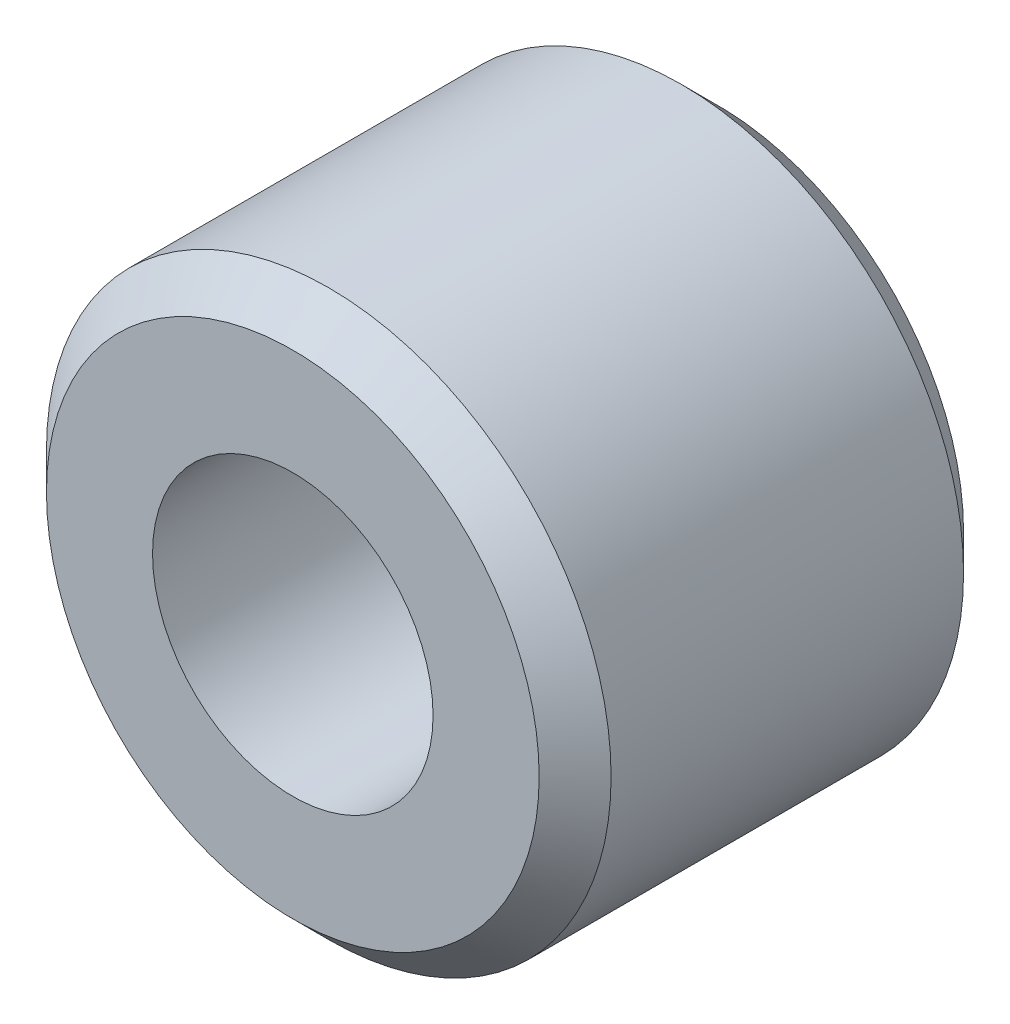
ISO-10303-21;
HEADER;
FILE_DESCRIPTION(('STEP AP214'),'2;1');
FILE_NAME('part.step','',(''),(''),'','','');
FILE_SCHEMA(('AUTOMOTIVE_DESIGN { 1 0 10303 214 1 1 1 1 }'));
ENDSEC;
DATA;
#1=APPLICATION_CONTEXT('core data for automotive mechanical design processes');
#2=APPLICATION_PROTOCOL_DEFINITION('international standard','automotive_design',2000,#1);
#3=PRODUCT_CONTEXT('',#1,'mechanical');
#4=PRODUCT('Part','Part','',(#3));
#5=PRODUCT_RELATED_PRODUCT_CATEGORY('part','',(#4));
#6=PRODUCT_DEFINITION_FORMATION('','',#4);
#7=PRODUCT_DEFINITION_CONTEXT('part definition',#1,'design');
#8=PRODUCT_DEFINITION('design','',#6,#7);
#9=PRODUCT_DEFINITION_SHAPE('','',#8);
#10=(LENGTH_UNIT() NAMED_UNIT(*) SI_UNIT(.MILLI.,.METRE.));
#11=(NAMED_UNIT(*) PLANE_ANGLE_UNIT() SI_UNIT($,.RADIAN.));
#12=(NAMED_UNIT(*) SI_UNIT($,.STERADIAN.) SOLID_ANGLE_UNIT());
#13=UNCERTAINTY_MEASURE_WITH_UNIT(LENGTH_MEASURE(1.E-05),#10,'distance_accuracy_value','');
#14=(GEOMETRIC_REPRESENTATION_CONTEXT(3) GLOBAL_UNCERTAINTY_ASSIGNED_CONTEXT((#13)) GLOBAL_UNIT_ASSIGNED_CONTEXT((#10,
#11,#12)) REPRESENTATION_CONTEXT('',''));
#15=CARTESIAN_POINT('',(0.,0.,0.));
#16=DIRECTION('',(0.,0.,1.));
#17=DIRECTION('',(1.,0.,0.));
#18=AXIS2_PLACEMENT_3D('',#15,#16,#17);
#19=CARTESIAN_POINT('',(0.,0.,2.9972));
#20=DIRECTION('',(0.,0.,1.));
#21=DIRECTION('',(1.,0.,0.));
#22=AXIS2_PLACEMENT_3D('',#19,#20,#21);
#23=PLANE('',#22);
#24=CARTESIAN_POINT('',(0.,0.,2.9972));
#25=DIRECTION('',(0.,0.,1.));
#26=DIRECTION('',(1.,0.,0.));
#27=AXIS2_PLACEMENT_3D('',#24,#25,#26);
#28=CIRCLE('',#27,1.7399);
#29=CARTESIAN_POINT('',(1.7399,0.,2.9972));
#30=VERTEX_POINT('',#29);
#31=EDGE_CURVE('E8',#30,#30,#28,.T.);
#32=ORIENTED_EDGE('',*,*,#31,.T.);
#33=EDGE_LOOP('',(#32));
#34=FACE_BOUND('',#33,.T.);
#35=CARTESIAN_POINT('',(0.,0.,2.9972));
#36=DIRECTION('',(0.,0.,1.));
#37=DIRECTION('',(1.,0.,0.));
#38=AXIS2_PLACEMENT_3D('',#35,#36,#37);
#39=CIRCLE('',#38,0.9906);
#40=CARTESIAN_POINT('',(0.9906,0.,2.9972));
#41=VERTEX_POINT('',#40);
#42=EDGE_CURVE('E32',#41,#41,#39,.T.);
#43=ORIENTED_EDGE('',*,*,#42,.F.);
#44=EDGE_LOOP('',(#43));
#45=FACE_BOUND('',#44,.T.);
#46=ADVANCED_FACE('F12',(#34,#45),#23,.T.);
#47=CARTESIAN_POINT('',(0.,0.,0.));
#48=DIRECTION('',(0.,0.,1.));
#49=DIRECTION('',(1.,0.,0.));
#50=AXIS2_PLACEMENT_3D('',#47,#48,#49);
#51=PLANE('',#50);
#52=CARTESIAN_POINT('',(0.,0.,0.));
#53=DIRECTION('',(0.,0.,1.));
#54=DIRECTION('',(1.,0.,0.));
#55=AXIS2_PLACEMENT_3D('',#52,#53,#54);
#56=CIRCLE('',#55,1.7399);
#57=CARTESIAN_POINT('',(1.7399,0.,0.));
#58=VERTEX_POINT('',#57);
#59=EDGE_CURVE('E19',#58,#58,#56,.F.);
#60=ORIENTED_EDGE('',*,*,#59,.T.);
#61=EDGE_LOOP('',(#60));
#62=FACE_BOUND('',#61,.T.);
#63=CARTESIAN_POINT('',(0.,0.,0.));
#64=DIRECTION('',(0.,0.,1.));
#65=DIRECTION('',(1.,0.,0.));
#66=AXIS2_PLACEMENT_3D('',#63,#64,#65);
#67=CIRCLE('',#66,0.9906);
#68=CARTESIAN_POINT('',(0.9906,0.,0.));
#69=VERTEX_POINT('',#68);
#70=EDGE_CURVE('E33',#69,#69,#67,.T.);
#71=ORIENTED_EDGE('',*,*,#70,.T.);
#72=EDGE_LOOP('',(#71));
#73=FACE_BOUND('',#72,.T.);
#74=ADVANCED_FACE('F43',(#62,#73),#51,.F.);
#75=CARTESIAN_POINT('',(0.,0.,2.9972));
#76=DIRECTION('',(0.,0.,-1.));
#77=DIRECTION('',(-1.,0.,0.));
#78=AXIS2_PLACEMENT_3D('',#75,#76,#77);
#79=CYLINDRICAL_SURFACE('',#78,1.9939);
#80=CARTESIAN_POINT('',(0.,0.,0.254000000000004));
#81=DIRECTION('',(0.,0.,1.));
#82=DIRECTION('',(1.,0.,0.));
#83=AXIS2_PLACEMENT_3D('',#80,#81,#82);
#84=CIRCLE('',#83,1.9939);
#85=CARTESIAN_POINT('',(1.9939,0.,0.254000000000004));
#86=VERTEX_POINT('',#85);
#87=EDGE_CURVE('E23',#86,#86,#84,.T.);
#88=ORIENTED_EDGE('',*,*,#87,.T.);
#89=EDGE_LOOP('',(#88));
#90=FACE_BOUND('',#89,.T.);
#91=CARTESIAN_POINT('',(0.,0.,2.7432));
#92=DIRECTION('',(0.,0.,1.));
#93=DIRECTION('',(1.,0.,0.));
#94=AXIS2_PLACEMENT_3D('',#91,#92,#93);
#95=CIRCLE('',#94,1.9939);
#96=CARTESIAN_POINT('',(1.9939,0.,2.7432));
#97=VERTEX_POINT('',#96);
#98=EDGE_CURVE('E27',#97,#97,#95,.F.);
#99=ORIENTED_EDGE('',*,*,#98,.T.);
#100=EDGE_LOOP('',(#99));
#101=FACE_BOUND('',#100,.T.);
#102=ADVANCED_FACE('F49',(#90,#101),#79,.T.);
#103=CARTESIAN_POINT('',(0.,0.,2.9972));
#104=DIRECTION('',(0.,0.,-1.));
#105=DIRECTION('',(-1.,0.,0.));
#106=AXIS2_PLACEMENT_3D('',#103,#104,#105);
#107=CYLINDRICAL_SURFACE('',#106,0.9906);
#108=ORIENTED_EDGE('',*,*,#42,.T.);
#109=EDGE_LOOP('',(#108));
#110=FACE_BOUND('',#109,.T.);
#111=ORIENTED_EDGE('',*,*,#70,.F.);
#112=EDGE_LOOP('',(#111));
#113=FACE_BOUND('',#112,.T.);
#114=ADVANCED_FACE('F39',(#110,#113),#107,.F.);
#115=CARTESIAN_POINT('',(0.,0.,0.254000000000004));
#116=DIRECTION('',(0.,0.,1.));
#117=DIRECTION('',(1.,0.,0.));
#118=AXIS2_PLACEMENT_3D('',#115,#116,#117);
#119=CONICAL_SURFACE('',#118,1.9939,0.785398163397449);
#120=ORIENTED_EDGE('',*,*,#59,.F.);
#121=EDGE_LOOP('',(#120));
#122=FACE_BOUND('',#121,.T.);
#123=ORIENTED_EDGE('',*,*,#87,.F.);
#124=EDGE_LOOP('',(#123));
#125=FACE_BOUND('',#124,.T.);
#126=ADVANCED_FACE('F55',(#122,#125),#119,.T.);
#127=CARTESIAN_POINT('',(0.,0.,2.9972));
#128=DIRECTION('',(0.,0.,-1.));
#129=DIRECTION('',(-1.,0.,0.));
#130=AXIS2_PLACEMENT_3D('',#127,#128,#129);
#131=CONICAL_SURFACE('',#130,1.7399,0.785398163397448);
#132=ORIENTED_EDGE('',*,*,#98,.F.);
#133=EDGE_LOOP('',(#132));
#134=FACE_BOUND('',#133,.T.);
#135=ORIENTED_EDGE('',*,*,#31,.F.);
#136=EDGE_LOOP('',(#135));
#137=FACE_BOUND('',#136,.T.);
#138=ADVANCED_FACE('F14',(#134,#137),#131,.T.);
#139=CLOSED_SHELL('',(#46,#74,#102,#114,#126,#138));
#140=MANIFOLD_SOLID_BREP('B1',#139);
#141=ADVANCED_BREP_SHAPE_REPRESENTATION('',(#18,#140),#14);
#142=SHAPE_DEFINITION_REPRESENTATION(#9,#141);
ENDSEC;
END-ISO-10303-21;
